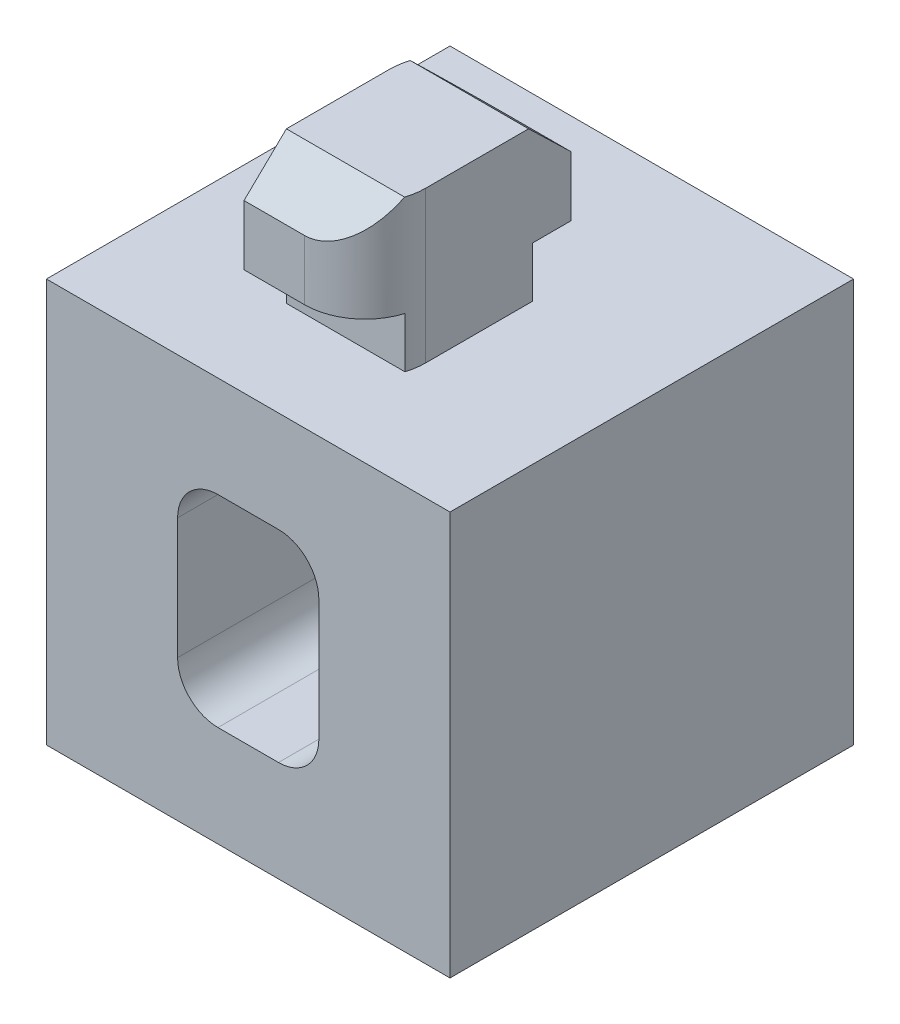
ISO-10303-21;
HEADER;
FILE_DESCRIPTION(('STEP AP214'),'2;1');
FILE_NAME('part.step','',(''),(''),'','','');
FILE_SCHEMA(('AUTOMOTIVE_DESIGN { 1 0 10303 214 1 1 1 1 }'));
ENDSEC;
DATA;
#1=APPLICATION_CONTEXT('core data for automotive mechanical design processes');
#2=APPLICATION_PROTOCOL_DEFINITION('international standard','automotive_design',2000,#1);
#3=PRODUCT_CONTEXT('',#1,'mechanical');
#4=PRODUCT('Part','Part','',(#3));
#5=PRODUCT_RELATED_PRODUCT_CATEGORY('part','',(#4));
#6=PRODUCT_DEFINITION_FORMATION('','',#4);
#7=PRODUCT_DEFINITION_CONTEXT('part definition',#1,'design');
#8=PRODUCT_DEFINITION('design','',#6,#7);
#9=PRODUCT_DEFINITION_SHAPE('','',#8);
#10=(LENGTH_UNIT() NAMED_UNIT(*) SI_UNIT(.MILLI.,.METRE.));
#11=(NAMED_UNIT(*) PLANE_ANGLE_UNIT() SI_UNIT($,.RADIAN.));
#12=(NAMED_UNIT(*) SI_UNIT($,.STERADIAN.) SOLID_ANGLE_UNIT());
#13=UNCERTAINTY_MEASURE_WITH_UNIT(LENGTH_MEASURE(1.E-05),#10,'distance_accuracy_value','');
#14=(GEOMETRIC_REPRESENTATION_CONTEXT(3) GLOBAL_UNCERTAINTY_ASSIGNED_CONTEXT((#13)) GLOBAL_UNIT_ASSIGNED_CONTEXT((#10,
#11,#12)) REPRESENTATION_CONTEXT('',''));
#15=CARTESIAN_POINT('',(0.,0.,0.));
#16=DIRECTION('',(0.,0.,1.));
#17=DIRECTION('',(1.,0.,0.));
#18=AXIS2_PLACEMENT_3D('',#15,#16,#17);
#19=CARTESIAN_POINT('',(-1.49999999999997,3.,10.));
#20=DIRECTION('',(0.,0.,-1.));
#21=DIRECTION('',(-1.,0.,0.));
#22=AXIS2_PLACEMENT_3D('',#19,#20,#21);
#23=CYLINDRICAL_SURFACE('',#22,2.00000000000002);
#24=DIRECTION('',(0.,0.,-1.));
#25=VECTOR('',#24,1.);
#26=CARTESIAN_POINT('',(-3.5,3.,10.));
#27=LINE('',#26,#25);
#28=CARTESIAN_POINT('',(-3.5,3.,10.));
#29=VERTEX_POINT('',#28);
#30=CARTESIAN_POINT('',(-3.5,3.,2.7));
#31=VERTEX_POINT('',#30);
#32=EDGE_CURVE('E488',#29,#31,#27,.T.);
#33=ORIENTED_EDGE('',*,*,#32,.T.);
#34=CARTESIAN_POINT('',(-1.49999999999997,3.,2.7));
#35=DIRECTION('',(0.,0.,-1.));
#36=DIRECTION('',(-1.,0.,0.));
#37=AXIS2_PLACEMENT_3D('',#34,#35,#36);
#38=CIRCLE('',#37,2.00000000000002);
#39=CARTESIAN_POINT('',(-1.49999999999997,5.,2.7));
#40=VERTEX_POINT('',#39);
#41=EDGE_CURVE('E345',#31,#40,#38,.T.);
#42=ORIENTED_EDGE('',*,*,#41,.T.);
#43=DIRECTION('',(0.,0.,-1.));
#44=VECTOR('',#43,1.);
#45=CARTESIAN_POINT('',(-1.49999999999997,5.,10.));
#46=LINE('',#45,#44);
#47=CARTESIAN_POINT('',(-1.49999999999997,5.,10.));
#48=VERTEX_POINT('',#47);
#49=EDGE_CURVE('E460',#48,#40,#46,.T.);
#50=ORIENTED_EDGE('',*,*,#49,.F.);
#51=CARTESIAN_POINT('',(-1.49999999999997,3.,10.));
#52=DIRECTION('',(0.,0.,1.));
#53=DIRECTION('',(1.,0.,0.));
#54=AXIS2_PLACEMENT_3D('',#51,#52,#53);
#55=CIRCLE('',#54,2.00000000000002);
#56=EDGE_CURVE('E419',#48,#29,#55,.T.);
#57=ORIENTED_EDGE('',*,*,#56,.T.);
#58=EDGE_LOOP('',(#33,#42,#50,#57));
#59=FACE_BOUND('',#58,.T.);
#60=ADVANCED_FACE('F35',(#59),#23,.F.);
#61=CARTESIAN_POINT('',(-3.5,-2.99999999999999,10.));
#62=DIRECTION('',(1.,0.,0.));
#63=DIRECTION('',(0.,0.,-1.));
#64=AXIS2_PLACEMENT_3D('',#61,#62,#63);
#65=PLANE('',#64);
#66=DIRECTION('',(0.,0.,-1.));
#67=VECTOR('',#66,1.);
#68=CARTESIAN_POINT('',(-3.49999999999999,-2.99999999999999,10.));
#69=LINE('',#68,#67);
#70=CARTESIAN_POINT('',(-3.49999999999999,-2.99999999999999,10.));
#71=VERTEX_POINT('',#70);
#72=CARTESIAN_POINT('',(-3.49999999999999,-2.99999999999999,2.7));
#73=VERTEX_POINT('',#72);
#74=EDGE_CURVE('E484',#71,#73,#69,.T.);
#75=ORIENTED_EDGE('',*,*,#74,.T.);
#76=DIRECTION('',(0.,1.,0.));
#77=VECTOR('',#76,1.);
#78=CARTESIAN_POINT('',(-3.5,-2.99999999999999,2.7));
#79=LINE('',#78,#77);
#80=EDGE_CURVE('E342',#73,#31,#79,.T.);
#81=ORIENTED_EDGE('',*,*,#80,.T.);
#82=ORIENTED_EDGE('',*,*,#32,.F.);
#83=DIRECTION('',(0.,-1.,0.));
#84=VECTOR('',#83,1.);
#85=CARTESIAN_POINT('',(-3.5,-2.99999999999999,10.));
#86=LINE('',#85,#84);
#87=EDGE_CURVE('E421',#29,#71,#86,.T.);
#88=ORIENTED_EDGE('',*,*,#87,.T.);
#89=EDGE_LOOP('',(#75,#81,#82,#88));
#90=FACE_BOUND('',#89,.T.);
#91=ADVANCED_FACE('F614',(#90),#65,.T.);
#92=CARTESIAN_POINT('',(-1.49999999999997,-2.99999999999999,10.));
#93=DIRECTION('',(0.,0.,-1.));
#94=DIRECTION('',(-1.,0.,0.));
#95=AXIS2_PLACEMENT_3D('',#92,#93,#94);
#96=CYLINDRICAL_SURFACE('',#95,2.00000000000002);
#97=DIRECTION('',(0.,0.,-1.));
#98=VECTOR('',#97,1.);
#99=CARTESIAN_POINT('',(-1.49999999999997,-4.99999999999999,10.));
#100=LINE('',#99,#98);
#101=CARTESIAN_POINT('',(-1.49999999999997,-4.99999999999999,10.));
#102=VERTEX_POINT('',#101);
#103=CARTESIAN_POINT('',(-1.49999999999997,-4.99999999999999,2.7));
#104=VERTEX_POINT('',#103);
#105=EDGE_CURVE('E480',#102,#104,#100,.T.);
#106=ORIENTED_EDGE('',*,*,#105,.T.);
#107=CARTESIAN_POINT('',(-1.49999999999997,-2.99999999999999,2.7));
#108=DIRECTION('',(0.,0.,-1.));
#109=DIRECTION('',(-1.,0.,0.));
#110=AXIS2_PLACEMENT_3D('',#107,#108,#109);
#111=CIRCLE('',#110,2.00000000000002);
#112=EDGE_CURVE('E339',#104,#73,#111,.T.);
#113=ORIENTED_EDGE('',*,*,#112,.T.);
#114=ORIENTED_EDGE('',*,*,#74,.F.);
#115=CARTESIAN_POINT('',(-1.49999999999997,-2.99999999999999,10.));
#116=DIRECTION('',(0.,0.,1.));
#117=DIRECTION('',(1.,0.,0.));
#118=AXIS2_PLACEMENT_3D('',#115,#116,#117);
#119=CIRCLE('',#118,2.00000000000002);
#120=EDGE_CURVE('E424',#71,#102,#119,.T.);
#121=ORIENTED_EDGE('',*,*,#120,.T.);
#122=EDGE_LOOP('',(#106,#113,#114,#121));
#123=FACE_BOUND('',#122,.T.);
#124=ADVANCED_FACE('F621',(#123),#96,.F.);
#125=CARTESIAN_POINT('',(-1.49999999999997,-4.99999999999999,10.));
#126=DIRECTION('',(0.,1.,0.));
#127=DIRECTION('',(0.,0.,1.));
#128=AXIS2_PLACEMENT_3D('',#125,#126,#127);
#129=PLANE('',#128);
#130=DIRECTION('',(0.,0.,-1.));
#131=VECTOR('',#130,1.);
#132=CARTESIAN_POINT('',(1.5,-4.99999999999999,10.));
#133=LINE('',#132,#131);
#134=CARTESIAN_POINT('',(1.5,-4.99999999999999,10.));
#135=VERTEX_POINT('',#134);
#136=CARTESIAN_POINT('',(1.5,-4.99999999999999,2.7));
#137=VERTEX_POINT('',#136);
#138=EDGE_CURVE('E476',#135,#137,#133,.T.);
#139=ORIENTED_EDGE('',*,*,#138,.T.);
#140=DIRECTION('',(-1.,0.,0.));
#141=VECTOR('',#140,1.);
#142=CARTESIAN_POINT('',(-1.49999999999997,-4.99999999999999,2.7));
#143=LINE('',#142,#141);
#144=EDGE_CURVE('E336',#137,#104,#143,.T.);
#145=ORIENTED_EDGE('',*,*,#144,.T.);
#146=ORIENTED_EDGE('',*,*,#105,.F.);
#147=DIRECTION('',(1.,0.,0.));
#148=VECTOR('',#147,1.);
#149=CARTESIAN_POINT('',(-1.49999999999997,-4.99999999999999,10.));
#150=LINE('',#149,#148);
#151=EDGE_CURVE('E426',#102,#135,#150,.T.);
#152=ORIENTED_EDGE('',*,*,#151,.T.);
#153=EDGE_LOOP('',(#139,#145,#146,#152));
#154=FACE_BOUND('',#153,.T.);
#155=ADVANCED_FACE('F680',(#154),#129,.T.);
#156=CARTESIAN_POINT('',(1.5,-2.99999999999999,10.));
#157=DIRECTION('',(0.,0.,-1.));
#158=DIRECTION('',(-1.,0.,0.));
#159=AXIS2_PLACEMENT_3D('',#156,#157,#158);
#160=CYLINDRICAL_SURFACE('',#159,2.);
#161=DIRECTION('',(0.,0.,-1.));
#162=VECTOR('',#161,1.);
#163=CARTESIAN_POINT('',(3.5,-2.99999999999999,10.));
#164=LINE('',#163,#162);
#165=CARTESIAN_POINT('',(3.5,-2.99999999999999,10.));
#166=VERTEX_POINT('',#165);
#167=CARTESIAN_POINT('',(3.5,-2.99999999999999,2.7));
#168=VERTEX_POINT('',#167);
#169=EDGE_CURVE('E472',#166,#168,#164,.T.);
#170=ORIENTED_EDGE('',*,*,#169,.T.);
#171=CARTESIAN_POINT('',(1.5,-2.99999999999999,2.7));
#172=DIRECTION('',(0.,0.,-1.));
#173=DIRECTION('',(-1.,0.,0.));
#174=AXIS2_PLACEMENT_3D('',#171,#172,#173);
#175=CIRCLE('',#174,2.);
#176=EDGE_CURVE('E333',#168,#137,#175,.T.);
#177=ORIENTED_EDGE('',*,*,#176,.T.);
#178=ORIENTED_EDGE('',*,*,#138,.F.);
#179=CARTESIAN_POINT('',(1.5,-2.99999999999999,10.));
#180=DIRECTION('',(0.,0.,1.));
#181=DIRECTION('',(1.,0.,0.));
#182=AXIS2_PLACEMENT_3D('',#179,#180,#181);
#183=CIRCLE('',#182,2.);
#184=EDGE_CURVE('E428',#135,#166,#183,.T.);
#185=ORIENTED_EDGE('',*,*,#184,.T.);
#186=EDGE_LOOP('',(#170,#177,#178,#185));
#187=FACE_BOUND('',#186,.T.);
#188=ADVANCED_FACE('F686',(#187),#160,.F.);
#189=CARTESIAN_POINT('',(3.5,-2.99999999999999,10.));
#190=DIRECTION('',(-1.,0.,0.));
#191=DIRECTION('',(0.,0.,1.));
#192=AXIS2_PLACEMENT_3D('',#189,#190,#191);
#193=PLANE('',#192);
#194=DIRECTION('',(0.,0.,-1.));
#195=VECTOR('',#194,1.);
#196=CARTESIAN_POINT('',(3.5,3.,10.));
#197=LINE('',#196,#195);
#198=CARTESIAN_POINT('',(3.5,3.,10.));
#199=VERTEX_POINT('',#198);
#200=CARTESIAN_POINT('',(3.5,3.,2.7));
#201=VERTEX_POINT('',#200);
#202=EDGE_CURVE('E468',#199,#201,#197,.T.);
#203=ORIENTED_EDGE('',*,*,#202,.T.);
#204=DIRECTION('',(0.,-1.,0.));
#205=VECTOR('',#204,1.);
#206=CARTESIAN_POINT('',(3.5,-2.99999999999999,2.7));
#207=LINE('',#206,#205);
#208=EDGE_CURVE('E329',#201,#168,#207,.T.);
#209=ORIENTED_EDGE('',*,*,#208,.T.);
#210=ORIENTED_EDGE('',*,*,#169,.F.);
#211=DIRECTION('',(0.,1.,0.));
#212=VECTOR('',#211,1.);
#213=CARTESIAN_POINT('',(3.5,-2.99999999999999,10.));
#214=LINE('',#213,#212);
#215=EDGE_CURVE('E430',#166,#199,#214,.T.);
#216=ORIENTED_EDGE('',*,*,#215,.T.);
#217=EDGE_LOOP('',(#203,#209,#210,#216));
#218=FACE_BOUND('',#217,.T.);
#219=ADVANCED_FACE('F702',(#218),#193,.T.);
#220=CARTESIAN_POINT('',(1.5,3.,10.));
#221=DIRECTION('',(0.,0.,-1.));
#222=DIRECTION('',(-1.,0.,0.));
#223=AXIS2_PLACEMENT_3D('',#220,#221,#222);
#224=CYLINDRICAL_SURFACE('',#223,2.);
#225=DIRECTION('',(0.,0.,-1.));
#226=VECTOR('',#225,1.);
#227=CARTESIAN_POINT('',(1.5,5.,10.));
#228=LINE('',#227,#226);
#229=CARTESIAN_POINT('',(1.5,5.,10.));
#230=VERTEX_POINT('',#229);
#231=CARTESIAN_POINT('',(1.5,5.,2.7));
#232=VERTEX_POINT('',#231);
#233=EDGE_CURVE('E464',#230,#232,#228,.T.);
#234=ORIENTED_EDGE('',*,*,#233,.T.);
#235=CARTESIAN_POINT('',(1.5,3.,2.7));
#236=DIRECTION('',(0.,0.,-1.));
#237=DIRECTION('',(-1.,0.,0.));
#238=AXIS2_PLACEMENT_3D('',#235,#236,#237);
#239=CIRCLE('',#238,2.);
#240=EDGE_CURVE('E326',#232,#201,#239,.T.);
#241=ORIENTED_EDGE('',*,*,#240,.T.);
#242=ORIENTED_EDGE('',*,*,#202,.F.);
#243=CARTESIAN_POINT('',(1.5,3.,10.));
#244=DIRECTION('',(0.,0.,1.));
#245=DIRECTION('',(1.,0.,0.));
#246=AXIS2_PLACEMENT_3D('',#243,#244,#245);
#247=CIRCLE('',#246,2.);
#248=EDGE_CURVE('E432',#199,#230,#247,.T.);
#249=ORIENTED_EDGE('',*,*,#248,.T.);
#250=EDGE_LOOP('',(#234,#241,#242,#249));
#251=FACE_BOUND('',#250,.T.);
#252=ADVANCED_FACE('F708',(#251),#224,.F.);
#253=CARTESIAN_POINT('',(-1.49999999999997,5.,10.));
#254=DIRECTION('',(0.,-1.,0.));
#255=DIRECTION('',(0.,0.,-1.));
#256=AXIS2_PLACEMENT_3D('',#253,#254,#255);
#257=PLANE('',#256);
#258=ORIENTED_EDGE('',*,*,#49,.T.);
#259=DIRECTION('',(1.,0.,0.));
#260=VECTOR('',#259,1.);
#261=CARTESIAN_POINT('',(-1.49999999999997,5.,2.7));
#262=LINE('',#261,#260);
#263=EDGE_CURVE('E521',#40,#232,#262,.T.);
#264=ORIENTED_EDGE('',*,*,#263,.T.);
#265=ORIENTED_EDGE('',*,*,#233,.F.);
#266=DIRECTION('',(-1.,0.,0.));
#267=VECTOR('',#266,1.);
#268=CARTESIAN_POINT('',(-1.49999999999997,5.,10.));
#269=LINE('',#268,#267);
#270=EDGE_CURVE('E435',#230,#48,#269,.T.);
#271=ORIENTED_EDGE('',*,*,#270,.T.);
#272=EDGE_LOOP('',(#258,#264,#265,#271));
#273=FACE_BOUND('',#272,.T.);
#274=ADVANCED_FACE('F711',(#273),#257,.T.);
#275=CARTESIAN_POINT('',(10.,9.99999999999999,10.));
#276=DIRECTION('',(0.,0.,1.));
#277=DIRECTION('',(1.,0.,0.));
#278=AXIS2_PLACEMENT_3D('',#275,#276,#277);
#279=PLANE('',#278);
#280=DIRECTION('',(0.,1.,0.));
#281=VECTOR('',#280,1.);
#282=CARTESIAN_POINT('',(10.,-10.,10.));
#283=LINE('',#282,#281);
#284=CARTESIAN_POINT('',(10.,-10.,10.));
#285=VERTEX_POINT('',#284);
#286=CARTESIAN_POINT('',(10.,9.99999999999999,10.));
#287=VERTEX_POINT('',#286);
#288=EDGE_CURVE('E492',#285,#287,#283,.T.);
#289=ORIENTED_EDGE('',*,*,#288,.T.);
#290=DIRECTION('',(-1.,0.,0.));
#291=VECTOR('',#290,1.);
#292=CARTESIAN_POINT('',(10.,9.99999999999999,10.));
#293=LINE('',#292,#291);
#294=CARTESIAN_POINT('',(-9.99999999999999,9.99999999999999,10.));
#295=VERTEX_POINT('',#294);
#296=EDGE_CURVE('E495',#287,#295,#293,.T.);
#297=ORIENTED_EDGE('',*,*,#296,.T.);
#298=DIRECTION('',(0.,-1.,0.));
#299=VECTOR('',#298,1.);
#300=CARTESIAN_POINT('',(-9.99999999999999,9.99999999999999,10.));
#301=LINE('',#300,#299);
#302=CARTESIAN_POINT('',(-9.99999999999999,-10.,10.));
#303=VERTEX_POINT('',#302);
#304=EDGE_CURVE('E498',#295,#303,#301,.T.);
#305=ORIENTED_EDGE('',*,*,#304,.T.);
#306=DIRECTION('',(1.,0.,0.));
#307=VECTOR('',#306,1.);
#308=CARTESIAN_POINT('',(-9.99999999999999,-10.,10.));
#309=LINE('',#308,#307);
#310=EDGE_CURVE('E500',#303,#285,#309,.T.);
#311=ORIENTED_EDGE('',*,*,#310,.T.);
#312=EDGE_LOOP('',(#289,#297,#305,#311));
#313=FACE_BOUND('',#312,.T.);
#314=ORIENTED_EDGE('',*,*,#87,.F.);
#315=ORIENTED_EDGE('',*,*,#56,.F.);
#316=ORIENTED_EDGE('',*,*,#270,.F.);
#317=ORIENTED_EDGE('',*,*,#248,.F.);
#318=ORIENTED_EDGE('',*,*,#215,.F.);
#319=ORIENTED_EDGE('',*,*,#184,.F.);
#320=ORIENTED_EDGE('',*,*,#151,.F.);
#321=ORIENTED_EDGE('',*,*,#120,.F.);
#322=EDGE_LOOP('',(#314,#315,#316,#317,#318,#319,#320,#321));
#323=FACE_BOUND('',#322,.T.);
#324=ADVANCED_FACE('F696',(#313,#323),#279,.T.);
#325=CARTESIAN_POINT('',(10.,9.99999999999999,-10.));
#326=DIRECTION('',(0.,0.,1.));
#327=DIRECTION('',(1.,0.,0.));
#328=AXIS2_PLACEMENT_3D('',#325,#326,#327);
#329=PLANE('',#328);
#330=DIRECTION('',(0.,1.,0.));
#331=VECTOR('',#330,1.);
#332=CARTESIAN_POINT('',(10.,-10.,-10.));
#333=LINE('',#332,#331);
#334=CARTESIAN_POINT('',(10.,-10.,-10.));
#335=VERTEX_POINT('',#334);
#336=CARTESIAN_POINT('',(10.,9.99999999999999,-10.));
#337=VERTEX_POINT('',#336);
#338=EDGE_CURVE('E491',#335,#337,#333,.T.);
#339=ORIENTED_EDGE('',*,*,#338,.F.);
#340=DIRECTION('',(1.,0.,0.));
#341=VECTOR('',#340,1.);
#342=CARTESIAN_POINT('',(-9.99999999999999,-10.,-10.));
#343=LINE('',#342,#341);
#344=CARTESIAN_POINT('',(-9.99999999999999,-10.,-10.));
#345=VERTEX_POINT('',#344);
#346=EDGE_CURVE('E496',#345,#335,#343,.T.);
#347=ORIENTED_EDGE('',*,*,#346,.F.);
#348=DIRECTION('',(0.,-1.,0.));
#349=VECTOR('',#348,1.);
#350=CARTESIAN_POINT('',(-9.99999999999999,9.99999999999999,-10.));
#351=LINE('',#350,#349);
#352=CARTESIAN_POINT('',(-9.99999999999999,9.99999999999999,-10.));
#353=VERTEX_POINT('',#352);
#354=EDGE_CURVE('E507',#353,#345,#351,.T.);
#355=ORIENTED_EDGE('',*,*,#354,.F.);
#356=DIRECTION('',(-1.,0.,0.));
#357=VECTOR('',#356,1.);
#358=CARTESIAN_POINT('',(10.,9.99999999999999,-10.));
#359=LINE('',#358,#357);
#360=EDGE_CURVE('E505',#337,#353,#359,.T.);
#361=ORIENTED_EDGE('',*,*,#360,.F.);
#362=EDGE_LOOP('',(#339,#347,#355,#361));
#363=FACE_BOUND('',#362,.T.);
#364=CARTESIAN_POINT('',(-1.49999999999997,3.,-10.));
#365=DIRECTION('',(0.,0.,1.));
#366=DIRECTION('',(1.,0.,0.));
#367=AXIS2_PLACEMENT_3D('',#364,#365,#366);
#368=CIRCLE('',#367,2.00000000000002);
#369=CARTESIAN_POINT('',(-1.49999999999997,5.,-10.));
#370=VERTEX_POINT('',#369);
#371=CARTESIAN_POINT('',(-3.5,3.,-10.));
#372=VERTEX_POINT('',#371);
#373=EDGE_CURVE('E418',#370,#372,#368,.T.);
#374=ORIENTED_EDGE('',*,*,#373,.T.);
#375=DIRECTION('',(0.,-1.,0.));
#376=VECTOR('',#375,1.);
#377=CARTESIAN_POINT('',(-3.5,-2.99999999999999,-10.));
#378=LINE('',#377,#376);
#379=CARTESIAN_POINT('',(-3.49999999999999,-2.99999999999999,-10.));
#380=VERTEX_POINT('',#379);
#381=EDGE_CURVE('E440',#372,#380,#378,.T.);
#382=ORIENTED_EDGE('',*,*,#381,.T.);
#383=CARTESIAN_POINT('',(-1.49999999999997,-2.99999999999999,-10.));
#384=DIRECTION('',(0.,0.,1.));
#385=DIRECTION('',(1.,0.,0.));
#386=AXIS2_PLACEMENT_3D('',#383,#384,#385);
#387=CIRCLE('',#386,2.00000000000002);
#388=CARTESIAN_POINT('',(-1.49999999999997,-4.99999999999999,-10.));
#389=VERTEX_POINT('',#388);
#390=EDGE_CURVE('E443',#380,#389,#387,.T.);
#391=ORIENTED_EDGE('',*,*,#390,.T.);
#392=DIRECTION('',(1.,0.,0.));
#393=VECTOR('',#392,1.);
#394=CARTESIAN_POINT('',(-1.49999999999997,-4.99999999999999,-10.));
#395=LINE('',#394,#393);
#396=CARTESIAN_POINT('',(1.5,-4.99999999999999,-10.));
#397=VERTEX_POINT('',#396);
#398=EDGE_CURVE('E446',#389,#397,#395,.T.);
#399=ORIENTED_EDGE('',*,*,#398,.T.);
#400=CARTESIAN_POINT('',(1.5,-2.99999999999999,-10.));
#401=DIRECTION('',(0.,0.,1.));
#402=DIRECTION('',(1.,0.,0.));
#403=AXIS2_PLACEMENT_3D('',#400,#401,#402);
#404=CIRCLE('',#403,2.);
#405=CARTESIAN_POINT('',(3.5,-2.99999999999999,-10.));
#406=VERTEX_POINT('',#405);
#407=EDGE_CURVE('E449',#397,#406,#404,.T.);
#408=ORIENTED_EDGE('',*,*,#407,.T.);
#409=DIRECTION('',(0.,1.,0.));
#410=VECTOR('',#409,1.);
#411=CARTESIAN_POINT('',(3.5,-2.99999999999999,-10.));
#412=LINE('',#411,#410);
#413=CARTESIAN_POINT('',(3.5,3.,-10.));
#414=VERTEX_POINT('',#413);
#415=EDGE_CURVE('E452',#406,#414,#412,.T.);
#416=ORIENTED_EDGE('',*,*,#415,.T.);
#417=CARTESIAN_POINT('',(1.5,3.,-10.));
#418=DIRECTION('',(0.,0.,1.));
#419=DIRECTION('',(1.,0.,0.));
#420=AXIS2_PLACEMENT_3D('',#417,#418,#419);
#421=CIRCLE('',#420,2.);
#422=CARTESIAN_POINT('',(1.5,5.,-10.));
#423=VERTEX_POINT('',#422);
#424=EDGE_CURVE('E455',#414,#423,#421,.T.);
#425=ORIENTED_EDGE('',*,*,#424,.T.);
#426=DIRECTION('',(-1.,0.,0.));
#427=VECTOR('',#426,1.);
#428=CARTESIAN_POINT('',(-1.49999999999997,5.,-10.));
#429=LINE('',#428,#427);
#430=EDGE_CURVE('E422',#423,#370,#429,.T.);
#431=ORIENTED_EDGE('',*,*,#430,.T.);
#432=EDGE_LOOP('',(#374,#382,#391,#399,#408,#416,#425,#431));
#433=FACE_BOUND('',#432,.T.);
#434=ADVANCED_FACE('F647',(#363,#433),#329,.F.);
#435=CARTESIAN_POINT('',(10.,-10.,10.));
#436=DIRECTION('',(-1.,0.,0.));
#437=DIRECTION('',(0.,0.,1.));
#438=AXIS2_PLACEMENT_3D('',#435,#436,#437);
#439=PLANE('',#438);
#440=ORIENTED_EDGE('',*,*,#338,.T.);
#441=DIRECTION('',(0.,0.,-1.));
#442=VECTOR('',#441,1.);
#443=CARTESIAN_POINT('',(10.,9.99999999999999,10.));
#444=LINE('',#443,#442);
#445=EDGE_CURVE('E518',#287,#337,#444,.T.);
#446=ORIENTED_EDGE('',*,*,#445,.F.);
#447=ORIENTED_EDGE('',*,*,#288,.F.);
#448=DIRECTION('',(0.,0.,-1.));
#449=VECTOR('',#448,1.);
#450=CARTESIAN_POINT('',(10.,-10.,10.));
#451=LINE('',#450,#449);
#452=EDGE_CURVE('E502',#285,#335,#451,.T.);
#453=ORIENTED_EDGE('',*,*,#452,.T.);
#454=EDGE_LOOP('',(#440,#446,#447,#453));
#455=FACE_BOUND('',#454,.T.);
#456=ADVANCED_FACE('F896',(#455),#439,.F.);
#457=CARTESIAN_POINT('',(10.,9.99999999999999,10.));
#458=DIRECTION('',(0.,-1.,0.));
#459=DIRECTION('',(0.,0.,-1.));
#460=AXIS2_PLACEMENT_3D('',#457,#458,#459);
#461=PLANE('',#460);
#462=DIRECTION('',(-1.,0.,0.));
#463=VECTOR('',#462,1.);
#464=CARTESIAN_POINT('',(3.,9.99999999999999,-1.09999999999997));
#465=LINE('',#464,#463);
#466=CARTESIAN_POINT('',(3.,9.99999999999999,-1.09999999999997));
#467=VERTEX_POINT('',#466);
#468=CARTESIAN_POINT('',(-2.78786220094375,9.99999999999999,-1.09999999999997));
#469=VERTEX_POINT('',#468);
#470=EDGE_CURVE('E405',#467,#469,#465,.T.);
#471=ORIENTED_EDGE('',*,*,#470,.F.);
#472=DIRECTION('',(0.,0.,-1.));
#473=VECTOR('',#472,1.);
#474=CARTESIAN_POINT('',(3.,9.99999999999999,5.10000000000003));
#475=LINE('',#474,#473);
#476=CARTESIAN_POINT('',(3.,9.99999999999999,4.20807235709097));
#477=VERTEX_POINT('',#476);
#478=EDGE_CURVE('E366',#477,#467,#475,.T.);
#479=ORIENTED_EDGE('',*,*,#478,.F.);
#480=CARTESIAN_POINT('',(0.,9.99999999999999,4.20807235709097));
#481=DIRECTION('',(0.,-1.,0.));
#482=DIRECTION('',(0.,0.,-1.));
#483=AXIS2_PLACEMENT_3D('',#480,#481,#482);
#484=CIRCLE('',#483,3.);
#485=CARTESIAN_POINT('',(2.86434374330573,9.99999999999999,5.10000000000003));
#486=VERTEX_POINT('',#485);
#487=EDGE_CURVE('E11',#477,#486,#484,.T.);
#488=ORIENTED_EDGE('',*,*,#487,.T.);
#489=DIRECTION('',(-1.,0.,0.));
#490=VECTOR('',#489,1.);
#491=CARTESIAN_POINT('',(3.,9.99999999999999,5.10000000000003));
#492=LINE('',#491,#490);
#493=CARTESIAN_POINT('',(-3.,9.99999999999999,5.10000000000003));
#494=VERTEX_POINT('',#493);
#495=EDGE_CURVE('E408',#486,#494,#492,.T.);
#496=ORIENTED_EDGE('',*,*,#495,.T.);
#497=DIRECTION('',(0.,0.,-1.));
#498=VECTOR('',#497,1.);
#499=CARTESIAN_POINT('',(-3.,9.99999999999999,5.10000000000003));
#500=LINE('',#499,#498);
#501=CARTESIAN_POINT('',(-3.,9.99999999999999,0.0080723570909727));
#502=VERTEX_POINT('',#501);
#503=EDGE_CURVE('E367',#494,#502,#500,.T.);
#504=ORIENTED_EDGE('',*,*,#503,.T.);
#505=CARTESIAN_POINT('',(0.,9.99999999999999,0.00807235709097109));
#506=DIRECTION('',(0.,-1.,0.));
#507=DIRECTION('',(0.,0.,-1.));
#508=AXIS2_PLACEMENT_3D('',#505,#506,#507);
#509=CIRCLE('',#508,3.);
#510=EDGE_CURVE('E43',#502,#469,#509,.T.);
#511=ORIENTED_EDGE('',*,*,#510,.T.);
#512=EDGE_LOOP('',(#471,#479,#488,#496,#504,#511));
#513=FACE_BOUND('',#512,.T.);
#514=ORIENTED_EDGE('',*,*,#360,.T.);
#515=DIRECTION('',(0.,0.,-1.));
#516=VECTOR('',#515,1.);
#517=CARTESIAN_POINT('',(-9.99999999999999,9.99999999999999,10.));
#518=LINE('',#517,#516);
#519=EDGE_CURVE('E515',#295,#353,#518,.T.);
#520=ORIENTED_EDGE('',*,*,#519,.F.);
#521=ORIENTED_EDGE('',*,*,#296,.F.);
#522=ORIENTED_EDGE('',*,*,#445,.T.);
#523=EDGE_LOOP('',(#514,#520,#521,#522));
#524=FACE_BOUND('',#523,.T.);
#525=ADVANCED_FACE('F552',(#513,#524),#461,.F.);
#526=CARTESIAN_POINT('',(-9.99999999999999,9.99999999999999,10.));
#527=DIRECTION('',(1.,0.,0.));
#528=DIRECTION('',(0.,0.,-1.));
#529=AXIS2_PLACEMENT_3D('',#526,#527,#528);
#530=PLANE('',#529);
#531=ORIENTED_EDGE('',*,*,#354,.T.);
#532=DIRECTION('',(0.,0.,-1.));
#533=VECTOR('',#532,1.);
#534=CARTESIAN_POINT('',(-9.99999999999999,-10.,10.));
#535=LINE('',#534,#533);
#536=EDGE_CURVE('E512',#303,#345,#535,.T.);
#537=ORIENTED_EDGE('',*,*,#536,.F.);
#538=ORIENTED_EDGE('',*,*,#304,.F.);
#539=ORIENTED_EDGE('',*,*,#519,.T.);
#540=EDGE_LOOP('',(#531,#537,#538,#539));
#541=FACE_BOUND('',#540,.T.);
#542=ADVANCED_FACE('F634',(#541),#530,.F.);
#543=CARTESIAN_POINT('',(-9.99999999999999,-10.,10.));
#544=DIRECTION('',(0.,1.,0.));
#545=DIRECTION('',(0.,0.,1.));
#546=AXIS2_PLACEMENT_3D('',#543,#544,#545);
#547=PLANE('',#546);
#548=DIRECTION('',(0.,0.,1.));
#549=VECTOR('',#548,1.);
#550=CARTESIAN_POINT('',(5.15,-10.,-2.7));
#551=LINE('',#550,#549);
#552=CARTESIAN_POINT('',(5.15,-10.,-2.7));
#553=VERTEX_POINT('',#552);
#554=CARTESIAN_POINT('',(5.15,-10.,2.7));
#555=VERTEX_POINT('',#554);
#556=EDGE_CURVE('E297',#553,#555,#551,.T.);
#557=ORIENTED_EDGE('',*,*,#556,.F.);
#558=DIRECTION('',(1.,0.,0.));
#559=VECTOR('',#558,1.);
#560=CARTESIAN_POINT('',(5.15,-10.,-2.7));
#561=LINE('',#560,#559);
#562=CARTESIAN_POINT('',(-5.15,-10.,-2.7));
#563=VERTEX_POINT('',#562);
#564=EDGE_CURVE('E304',#563,#553,#561,.T.);
#565=ORIENTED_EDGE('',*,*,#564,.F.);
#566=DIRECTION('',(0.,0.,1.));
#567=VECTOR('',#566,1.);
#568=CARTESIAN_POINT('',(-5.15,-10.,-2.7));
#569=LINE('',#568,#567);
#570=CARTESIAN_POINT('',(-5.15,-10.,2.7));
#571=VERTEX_POINT('',#570);
#572=EDGE_CURVE('E330',#563,#571,#569,.T.);
#573=ORIENTED_EDGE('',*,*,#572,.T.);
#574=DIRECTION('',(1.,0.,0.));
#575=VECTOR('',#574,1.);
#576=CARTESIAN_POINT('',(5.15,-10.,2.7));
#577=LINE('',#576,#575);
#578=EDGE_CURVE('E318',#571,#555,#577,.T.);
#579=ORIENTED_EDGE('',*,*,#578,.T.);
#580=EDGE_LOOP('',(#557,#565,#573,#579));
#581=FACE_BOUND('',#580,.T.);
#582=ORIENTED_EDGE('',*,*,#346,.T.);
#583=ORIENTED_EDGE('',*,*,#452,.F.);
#584=ORIENTED_EDGE('',*,*,#310,.F.);
#585=ORIENTED_EDGE('',*,*,#536,.T.);
#586=EDGE_LOOP('',(#582,#583,#584,#585));
#587=FACE_BOUND('',#586,.T.);
#588=ADVANCED_FACE('F316',(#581,#587),#547,.F.);
#589=CARTESIAN_POINT('',(-1.49999999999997,3.,-2.7));
#590=DIRECTION('',(0.,0.,-1.));
#591=DIRECTION('',(-1.,0.,0.));
#592=AXIS2_PLACEMENT_3D('',#589,#590,#591);
#593=CIRCLE('',#592,2.00000000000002);
#594=CARTESIAN_POINT('',(-3.5,3.,-2.7));
#595=VERTEX_POINT('',#594);
#596=CARTESIAN_POINT('',(-1.49999999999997,5.,-2.7));
#597=VERTEX_POINT('',#596);
#598=EDGE_CURVE('E360',#595,#597,#593,.T.);
#599=ORIENTED_EDGE('',*,*,#598,.F.);
#600=EDGE_CURVE('E487',#595,#372,#27,.T.);
#601=ORIENTED_EDGE('',*,*,#600,.T.);
#602=ORIENTED_EDGE('',*,*,#373,.F.);
#603=EDGE_CURVE('E437',#597,#370,#46,.T.);
#604=ORIENTED_EDGE('',*,*,#603,.F.);
#605=EDGE_LOOP('',(#599,#601,#602,#604));
#606=FACE_BOUND('',#605,.T.);
#607=ADVANCED_FACE('F617',(#606),#23,.F.);
#608=DIRECTION('',(0.,1.,0.));
#609=VECTOR('',#608,1.);
#610=CARTESIAN_POINT('',(-3.5,-2.99999999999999,-2.7));
#611=LINE('',#610,#609);
#612=CARTESIAN_POINT('',(-3.49999999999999,-2.99999999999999,-2.7));
#613=VERTEX_POINT('',#612);
#614=EDGE_CURVE('E358',#613,#595,#611,.T.);
#615=ORIENTED_EDGE('',*,*,#614,.F.);
#616=EDGE_CURVE('E483',#613,#380,#69,.T.);
#617=ORIENTED_EDGE('',*,*,#616,.T.);
#618=ORIENTED_EDGE('',*,*,#381,.F.);
#619=ORIENTED_EDGE('',*,*,#600,.F.);
#620=EDGE_LOOP('',(#615,#617,#618,#619));
#621=FACE_BOUND('',#620,.T.);
#622=ADVANCED_FACE('F624',(#621),#65,.T.);
#623=CARTESIAN_POINT('',(-1.49999999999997,-2.99999999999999,-2.7));
#624=DIRECTION('',(0.,0.,-1.));
#625=DIRECTION('',(-1.,0.,0.));
#626=AXIS2_PLACEMENT_3D('',#623,#624,#625);
#627=CIRCLE('',#626,2.00000000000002);
#628=CARTESIAN_POINT('',(-1.49999999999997,-4.99999999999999,-2.7));
#629=VERTEX_POINT('',#628);
#630=EDGE_CURVE('E356',#629,#613,#627,.T.);
#631=ORIENTED_EDGE('',*,*,#630,.F.);
#632=EDGE_CURVE('E479',#629,#389,#100,.T.);
#633=ORIENTED_EDGE('',*,*,#632,.T.);
#634=ORIENTED_EDGE('',*,*,#390,.F.);
#635=ORIENTED_EDGE('',*,*,#616,.F.);
#636=EDGE_LOOP('',(#631,#633,#634,#635));
#637=FACE_BOUND('',#636,.T.);
#638=ADVANCED_FACE('F632',(#637),#96,.F.);
#639=DIRECTION('',(-1.,0.,0.));
#640=VECTOR('',#639,1.);
#641=CARTESIAN_POINT('',(-1.49999999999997,-4.99999999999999,-2.7));
#642=LINE('',#641,#640);
#643=CARTESIAN_POINT('',(1.5,-4.99999999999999,-2.7));
#644=VERTEX_POINT('',#643);
#645=EDGE_CURVE('E354',#644,#629,#642,.T.);
#646=ORIENTED_EDGE('',*,*,#645,.F.);
#647=EDGE_CURVE('E475',#644,#397,#133,.T.);
#648=ORIENTED_EDGE('',*,*,#647,.T.);
#649=ORIENTED_EDGE('',*,*,#398,.F.);
#650=ORIENTED_EDGE('',*,*,#632,.F.);
#651=EDGE_LOOP('',(#646,#648,#649,#650));
#652=FACE_BOUND('',#651,.T.);
#653=ADVANCED_FACE('F670',(#652),#129,.T.);
#654=CARTESIAN_POINT('',(1.5,-2.99999999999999,-2.7));
#655=DIRECTION('',(0.,0.,-1.));
#656=DIRECTION('',(-1.,0.,0.));
#657=AXIS2_PLACEMENT_3D('',#654,#655,#656);
#658=CIRCLE('',#657,2.);
#659=CARTESIAN_POINT('',(3.5,-2.99999999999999,-2.7));
#660=VERTEX_POINT('',#659);
#661=EDGE_CURVE('E352',#660,#644,#658,.T.);
#662=ORIENTED_EDGE('',*,*,#661,.F.);
#663=EDGE_CURVE('E471',#660,#406,#164,.T.);
#664=ORIENTED_EDGE('',*,*,#663,.T.);
#665=ORIENTED_EDGE('',*,*,#407,.F.);
#666=ORIENTED_EDGE('',*,*,#647,.F.);
#667=EDGE_LOOP('',(#662,#664,#665,#666));
#668=FACE_BOUND('',#667,.T.);
#669=ADVANCED_FACE('F666',(#668),#160,.F.);
#670=DIRECTION('',(0.,-1.,0.));
#671=VECTOR('',#670,1.);
#672=CARTESIAN_POINT('',(3.5,-2.99999999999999,-2.7));
#673=LINE('',#672,#671);
#674=CARTESIAN_POINT('',(3.5,3.,-2.7));
#675=VERTEX_POINT('',#674);
#676=EDGE_CURVE('E350',#675,#660,#673,.T.);
#677=ORIENTED_EDGE('',*,*,#676,.F.);
#678=EDGE_CURVE('E467',#675,#414,#197,.T.);
#679=ORIENTED_EDGE('',*,*,#678,.T.);
#680=ORIENTED_EDGE('',*,*,#415,.F.);
#681=ORIENTED_EDGE('',*,*,#663,.F.);
#682=EDGE_LOOP('',(#677,#679,#680,#681));
#683=FACE_BOUND('',#682,.T.);
#684=ADVANCED_FACE('F660',(#683),#193,.T.);
#685=CARTESIAN_POINT('',(1.5,3.,-2.7));
#686=DIRECTION('',(0.,0.,-1.));
#687=DIRECTION('',(-1.,0.,0.));
#688=AXIS2_PLACEMENT_3D('',#685,#686,#687);
#689=CIRCLE('',#688,2.);
#690=CARTESIAN_POINT('',(1.5,5.,-2.7));
#691=VERTEX_POINT('',#690);
#692=EDGE_CURVE('E348',#691,#675,#689,.T.);
#693=ORIENTED_EDGE('',*,*,#692,.F.);
#694=EDGE_CURVE('E463',#691,#423,#228,.T.);
#695=ORIENTED_EDGE('',*,*,#694,.T.);
#696=ORIENTED_EDGE('',*,*,#424,.F.);
#697=ORIENTED_EDGE('',*,*,#678,.F.);
#698=EDGE_LOOP('',(#693,#695,#696,#697));
#699=FACE_BOUND('',#698,.T.);
#700=ADVANCED_FACE('F657',(#699),#224,.F.);
#701=DIRECTION('',(1.,0.,0.));
#702=VECTOR('',#701,1.);
#703=CARTESIAN_POINT('',(-1.49999999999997,5.,-2.7));
#704=LINE('',#703,#702);
#705=EDGE_CURVE('E524',#597,#691,#704,.T.);
#706=ORIENTED_EDGE('',*,*,#705,.F.);
#707=ORIENTED_EDGE('',*,*,#603,.T.);
#708=ORIENTED_EDGE('',*,*,#430,.F.);
#709=ORIENTED_EDGE('',*,*,#694,.F.);
#710=EDGE_LOOP('',(#706,#707,#708,#709));
#711=FACE_BOUND('',#710,.T.);
#712=ADVANCED_FACE('F652',(#711),#257,.T.);
#713=CARTESIAN_POINT('',(3.,17.5,5.10807235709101));
#714=DIRECTION('',(0.,-1.,0.));
#715=DIRECTION('',(0.,0.,-1.));
#716=AXIS2_PLACEMENT_3D('',#713,#714,#715);
#717=PLANE('',#716);
#718=DIRECTION('',(-1.,0.,0.));
#719=VECTOR('',#718,1.);
#720=CARTESIAN_POINT('',(3.,17.5,-0.891927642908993));
#721=LINE('',#720,#719);
#722=CARTESIAN_POINT('',(3.,17.5,-0.891927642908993));
#723=VERTEX_POINT('',#722);
#724=CARTESIAN_POINT('',(-2.86181760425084,17.5,-0.891927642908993));
#725=VERTEX_POINT('',#724);
#726=EDGE_CURVE('E377',#723,#725,#721,.T.);
#727=ORIENTED_EDGE('',*,*,#726,.T.);
#728=CARTESIAN_POINT('',(0.,17.5,0.00807235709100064));
#729=DIRECTION('',(0.,-1.,0.));
#730=DIRECTION('',(0.,0.,-1.));
#731=AXIS2_PLACEMENT_3D('',#728,#729,#730);
#732=CIRCLE('',#731,3.);
#733=CARTESIAN_POINT('',(-3.,17.5,0.00807235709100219));
#734=VERTEX_POINT('',#733);
#735=EDGE_CURVE('E533',#725,#734,#732,.F.);
#736=ORIENTED_EDGE('',*,*,#735,.T.);
#737=DIRECTION('',(0.,0.,1.));
#738=VECTOR('',#737,1.);
#739=CARTESIAN_POINT('',(-3.,17.5,5.10807235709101));
#740=LINE('',#739,#738);
#741=CARTESIAN_POINT('',(-3.,17.5,5.10807235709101));
#742=VERTEX_POINT('',#741);
#743=EDGE_CURVE('E362',#734,#742,#740,.T.);
#744=ORIENTED_EDGE('',*,*,#743,.T.);
#745=DIRECTION('',(-1.,0.,0.));
#746=VECTOR('',#745,1.);
#747=CARTESIAN_POINT('',(3.,17.5,5.10807235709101));
#748=LINE('',#747,#746);
#749=CARTESIAN_POINT('',(2.86181760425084,17.5,5.10807235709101));
#750=VERTEX_POINT('',#749);
#751=EDGE_CURVE('E416',#750,#742,#748,.T.);
#752=ORIENTED_EDGE('',*,*,#751,.F.);
#753=CARTESIAN_POINT('',(0.,17.5,4.208072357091));
#754=DIRECTION('',(0.,-1.,0.));
#755=DIRECTION('',(0.,0.,-1.));
#756=AXIS2_PLACEMENT_3D('',#753,#754,#755);
#757=CIRCLE('',#756,3.);
#758=CARTESIAN_POINT('',(3.,17.5,4.208072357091));
#759=VERTEX_POINT('',#758);
#760=EDGE_CURVE('E531',#750,#759,#757,.F.);
#761=ORIENTED_EDGE('',*,*,#760,.T.);
#762=DIRECTION('',(0.,0.,1.));
#763=VECTOR('',#762,1.);
#764=CARTESIAN_POINT('',(3.,17.5,5.10807235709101));
#765=LINE('',#764,#763);
#766=EDGE_CURVE('E363',#723,#759,#765,.T.);
#767=ORIENTED_EDGE('',*,*,#766,.F.);
#768=EDGE_LOOP('',(#727,#736,#744,#752,#761,#767));
#769=FACE_BOUND('',#768,.T.);
#770=ADVANCED_FACE('F591',(#769),#717,.F.);
#771=CARTESIAN_POINT('',(3.,17.5,5.10807235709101));
#772=DIRECTION('',(0.,-0.719339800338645,-0.694658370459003));
#773=DIRECTION('',(0.,0.694658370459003,-0.719339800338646));
#774=AXIS2_PLACEMENT_3D('',#771,#772,#773);
#775=PLANE('',#774);
#776=DIRECTION('',(-1.,0.,0.));
#777=VECTOR('',#776,1.);
#778=CARTESIAN_POINT('',(3.,15.4720535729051,7.20807235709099));
#779=LINE('',#778,#777);
#780=CARTESIAN_POINT('',(0.,15.4720535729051,7.20807235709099));
#781=VERTEX_POINT('',#780);
#782=CARTESIAN_POINT('',(-3.,15.4720535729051,7.20807235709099));
#783=VERTEX_POINT('',#782);
#784=EDGE_CURVE('E414',#781,#783,#779,.T.);
#785=ORIENTED_EDGE('',*,*,#784,.F.);
#786=CARTESIAN_POINT('',(0.,18.3691198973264,4.20807235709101));
#787=DIRECTION('',(0.,-0.719339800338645,-0.694658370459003));
#788=DIRECTION('',(0.,0.694658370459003,-0.719339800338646));
#789=AXIS2_PLACEMENT_3D('',#786,#787,#788);
#790=ELLIPSE('',#789,4.17049077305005,3.);
#791=EDGE_CURVE('E548',#781,#750,#790,.F.);
#792=ORIENTED_EDGE('',*,*,#791,.T.);
#793=ORIENTED_EDGE('',*,*,#751,.T.);
#794=DIRECTION('',(0.,-0.694658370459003,0.719339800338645));
#795=VECTOR('',#794,1.);
#796=CARTESIAN_POINT('',(-3.,17.5,5.10807235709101));
#797=LINE('',#796,#795);
#798=EDGE_CURVE('E380',#742,#783,#797,.T.);
#799=ORIENTED_EDGE('',*,*,#798,.T.);
#800=EDGE_LOOP('',(#785,#792,#793,#799));
#801=FACE_BOUND('',#800,.T.);
#802=ADVANCED_FACE('F589',(#801),#775,.F.);
#803=CARTESIAN_POINT('',(3.,12.5,7.20807235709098));
#804=DIRECTION('',(0.,0.,-1.));
#805=DIRECTION('',(0.,1.,0.));
#806=AXIS2_PLACEMENT_3D('',#803,#804,#805);
#807=PLANE('',#806);
#808=DIRECTION('',(-1.,0.,0.));
#809=VECTOR('',#808,1.);
#810=CARTESIAN_POINT('',(3.,12.5,7.20807235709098));
#811=LINE('',#810,#809);
#812=CARTESIAN_POINT('',(0.,12.5,7.20807235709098));
#813=VERTEX_POINT('',#812);
#814=CARTESIAN_POINT('',(-3.,12.5,7.20807235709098));
#815=VERTEX_POINT('',#814);
#816=EDGE_CURVE('E412',#813,#815,#811,.T.);
#817=ORIENTED_EDGE('',*,*,#816,.F.);
#818=DIRECTION('',(0.,-1.,0.));
#819=VECTOR('',#818,1.);
#820=CARTESIAN_POINT('',(0.,15.4720535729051,7.20807235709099));
#821=LINE('',#820,#819);
#822=EDGE_CURVE('E50',#813,#781,#821,.F.);
#823=ORIENTED_EDGE('',*,*,#822,.T.);
#824=ORIENTED_EDGE('',*,*,#784,.T.);
#825=DIRECTION('',(0.,-1.,0.));
#826=VECTOR('',#825,1.);
#827=CARTESIAN_POINT('',(-3.,12.5,7.20807235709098));
#828=LINE('',#827,#826);
#829=EDGE_CURVE('E383',#783,#815,#828,.T.);
#830=ORIENTED_EDGE('',*,*,#829,.T.);
#831=EDGE_LOOP('',(#817,#823,#824,#830));
#832=FACE_BOUND('',#831,.T.);
#833=ADVANCED_FACE('F600',(#832),#807,.F.);
#834=CARTESIAN_POINT('',(3.,12.5,7.20807235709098));
#835=DIRECTION('',(0.,1.,0.));
#836=DIRECTION('',(0.,0.,1.));
#837=AXIS2_PLACEMENT_3D('',#834,#835,#836);
#838=PLANE('',#837);
#839=DIRECTION('',(-1.,0.,0.));
#840=VECTOR('',#839,1.);
#841=CARTESIAN_POINT('',(3.,12.5,5.10000000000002));
#842=LINE('',#841,#840);
#843=CARTESIAN_POINT('',(2.86434374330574,12.5,5.10000000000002));
#844=VERTEX_POINT('',#843);
#845=CARTESIAN_POINT('',(-3.,12.5,5.10000000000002));
#846=VERTEX_POINT('',#845);
#847=EDGE_CURVE('E410',#844,#846,#842,.T.);
#848=ORIENTED_EDGE('',*,*,#847,.F.);
#849=CARTESIAN_POINT('',(0.,12.5,4.20807235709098));
#850=DIRECTION('',(0.,1.,0.));
#851=DIRECTION('',(0.,0.,1.));
#852=AXIS2_PLACEMENT_3D('',#849,#850,#851);
#853=CIRCLE('',#852,3.);
#854=EDGE_CURVE('E58',#844,#813,#853,.F.);
#855=ORIENTED_EDGE('',*,*,#854,.T.);
#856=ORIENTED_EDGE('',*,*,#816,.T.);
#857=DIRECTION('',(0.,0.,-1.));
#858=VECTOR('',#857,1.);
#859=CARTESIAN_POINT('',(-3.,12.5,7.20807235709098));
#860=LINE('',#859,#858);
#861=EDGE_CURVE('E386',#815,#846,#860,.T.);
#862=ORIENTED_EDGE('',*,*,#861,.T.);
#863=EDGE_LOOP('',(#848,#855,#856,#862));
#864=FACE_BOUND('',#863,.T.);
#865=ADVANCED_FACE('F601',(#864),#838,.F.);
#866=CARTESIAN_POINT('',(3.,12.5,5.10000000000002));
#867=DIRECTION('',(0.,0.,-1.));
#868=DIRECTION('',(0.,1.,0.));
#869=AXIS2_PLACEMENT_3D('',#866,#867,#868);
#870=PLANE('',#869);
#871=ORIENTED_EDGE('',*,*,#495,.F.);
#872=DIRECTION('',(0.,1.,0.));
#873=VECTOR('',#872,1.);
#874=CARTESIAN_POINT('',(2.86434374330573,9.99999999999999,5.10000000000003));
#875=LINE('',#874,#873);
#876=EDGE_CURVE('E544',#486,#844,#875,.T.);
#877=ORIENTED_EDGE('',*,*,#876,.T.);
#878=ORIENTED_EDGE('',*,*,#847,.T.);
#879=DIRECTION('',(0.,-1.,0.));
#880=VECTOR('',#879,1.);
#881=CARTESIAN_POINT('',(-3.,12.5,5.10000000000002));
#882=LINE('',#881,#880);
#883=EDGE_CURVE('E389',#846,#494,#882,.T.);
#884=ORIENTED_EDGE('',*,*,#883,.T.);
#885=EDGE_LOOP('',(#871,#877,#878,#884));
#886=FACE_BOUND('',#885,.T.);
#887=ADVANCED_FACE('F583',(#886),#870,.F.);
#888=CARTESIAN_POINT('',(3.,12.5,-1.09999999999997));
#889=DIRECTION('',(0.,0.,1.));
#890=DIRECTION('',(0.,-1.,0.));
#891=AXIS2_PLACEMENT_3D('',#888,#889,#890);
#892=PLANE('',#891);
#893=ORIENTED_EDGE('',*,*,#470,.T.);
#894=DIRECTION('',(0.,1.,0.));
#895=VECTOR('',#894,1.);
#896=CARTESIAN_POINT('',(-2.78786220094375,9.99999999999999,-1.09999999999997));
#897=LINE('',#896,#895);
#898=CARTESIAN_POINT('',(-2.78786220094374,12.5,-1.09999999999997));
#899=VERTEX_POINT('',#898);
#900=EDGE_CURVE('E537',#469,#899,#897,.T.);
#901=ORIENTED_EDGE('',*,*,#900,.T.);
#902=DIRECTION('',(-1.,0.,0.));
#903=VECTOR('',#902,1.);
#904=CARTESIAN_POINT('',(3.,12.5,-1.09999999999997));
#905=LINE('',#904,#903);
#906=CARTESIAN_POINT('',(3.,12.5,-1.09999999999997));
#907=VERTEX_POINT('',#906);
#908=EDGE_CURVE('E402',#907,#899,#905,.T.);
#909=ORIENTED_EDGE('',*,*,#908,.F.);
#910=DIRECTION('',(0.,1.,0.));
#911=VECTOR('',#910,1.);
#912=CARTESIAN_POINT('',(3.,12.5,-1.09999999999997));
#913=LINE('',#912,#911);
#914=EDGE_CURVE('E369',#467,#907,#913,.T.);
#915=ORIENTED_EDGE('',*,*,#914,.F.);
#916=EDGE_LOOP('',(#893,#901,#909,#915));
#917=FACE_BOUND('',#916,.T.);
#918=ADVANCED_FACE('F561',(#917),#892,.F.);
#919=CARTESIAN_POINT('',(3.,12.5,-1.09999999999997));
#920=DIRECTION('',(0.,1.,0.));
#921=DIRECTION('',(0.,0.,1.));
#922=AXIS2_PLACEMENT_3D('',#919,#920,#921);
#923=PLANE('',#922);
#924=ORIENTED_EDGE('',*,*,#908,.T.);
#925=CARTESIAN_POINT('',(0.,12.5,0.00807235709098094));
#926=DIRECTION('',(0.,1.,0.));
#927=DIRECTION('',(0.,0.,1.));
#928=AXIS2_PLACEMENT_3D('',#925,#926,#927);
#929=CIRCLE('',#928,3.);
#930=CARTESIAN_POINT('',(0.,12.5,-2.99192764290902));
#931=VERTEX_POINT('',#930);
#932=EDGE_CURVE('E539',#899,#931,#929,.F.);
#933=ORIENTED_EDGE('',*,*,#932,.T.);
#934=DIRECTION('',(-1.,0.,0.));
#935=VECTOR('',#934,1.);
#936=CARTESIAN_POINT('',(3.,12.5,-2.99192764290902));
#937=LINE('',#936,#935);
#938=CARTESIAN_POINT('',(3.,12.5,-2.99192764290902));
#939=VERTEX_POINT('',#938);
#940=EDGE_CURVE('E399',#939,#931,#937,.T.);
#941=ORIENTED_EDGE('',*,*,#940,.F.);
#942=DIRECTION('',(0.,0.,-1.));
#943=VECTOR('',#942,1.);
#944=CARTESIAN_POINT('',(3.,12.5,-1.09999999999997));
#945=LINE('',#944,#943);
#946=EDGE_CURVE('E371',#907,#939,#945,.T.);
#947=ORIENTED_EDGE('',*,*,#946,.F.);
#948=EDGE_LOOP('',(#924,#933,#941,#947));
#949=FACE_BOUND('',#948,.T.);
#950=ADVANCED_FACE('F568',(#949),#923,.F.);
#951=CARTESIAN_POINT('',(3.,12.5,-2.99192764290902));
#952=DIRECTION('',(0.,0.,1.));
#953=DIRECTION('',(0.,-1.,0.));
#954=AXIS2_PLACEMENT_3D('',#951,#952,#953);
#955=PLANE('',#954);
#956=ORIENTED_EDGE('',*,*,#940,.T.);
#957=DIRECTION('',(0.,1.,0.));
#958=VECTOR('',#957,1.);
#959=CARTESIAN_POINT('',(0.,12.5,-2.99192764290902));
#960=LINE('',#959,#958);
#961=CARTESIAN_POINT('',(0.,15.4720535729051,-2.99192764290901));
#962=VERTEX_POINT('',#961);
#963=EDGE_CURVE('E526',#931,#962,#960,.T.);
#964=ORIENTED_EDGE('',*,*,#963,.T.);
#965=DIRECTION('',(-1.,0.,0.));
#966=VECTOR('',#965,1.);
#967=CARTESIAN_POINT('',(3.,15.4720535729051,-2.99192764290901));
#968=LINE('',#967,#966);
#969=CARTESIAN_POINT('',(3.,15.4720535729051,-2.99192764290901));
#970=VERTEX_POINT('',#969);
#971=EDGE_CURVE('E396',#970,#962,#968,.T.);
#972=ORIENTED_EDGE('',*,*,#971,.F.);
#973=DIRECTION('',(0.,1.,0.));
#974=VECTOR('',#973,1.);
#975=CARTESIAN_POINT('',(3.,12.5,-2.99192764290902));
#976=LINE('',#975,#974);
#977=EDGE_CURVE('E373',#939,#970,#976,.T.);
#978=ORIENTED_EDGE('',*,*,#977,.F.);
#979=EDGE_LOOP('',(#956,#964,#972,#978));
#980=FACE_BOUND('',#979,.T.);
#981=ADVANCED_FACE('F572',(#980),#955,.F.);
#982=CARTESIAN_POINT('',(3.,17.5,-0.891927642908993));
#983=DIRECTION('',(0.,-0.71933980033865,0.694658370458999));
#984=DIRECTION('',(0.,-0.694658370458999,-0.71933980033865));
#985=AXIS2_PLACEMENT_3D('',#982,#983,#984);
#986=PLANE('',#985);
#987=ORIENTED_EDGE('',*,*,#971,.T.);
#988=CARTESIAN_POINT('',(0.,18.3691198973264,0.00807235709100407));
#989=DIRECTION('',(0.,-0.71933980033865,0.694658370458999));
#990=DIRECTION('',(0.,0.694658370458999,0.71933980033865));
#991=AXIS2_PLACEMENT_3D('',#988,#989,#990);
#992=ELLIPSE('',#991,4.17049077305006,3.);
#993=EDGE_CURVE('E529',#962,#725,#992,.F.);
#994=ORIENTED_EDGE('',*,*,#993,.T.);
#995=ORIENTED_EDGE('',*,*,#726,.F.);
#996=DIRECTION('',(0.,0.694658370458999,0.71933980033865));
#997=VECTOR('',#996,1.);
#998=CARTESIAN_POINT('',(3.,17.5,-0.891927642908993));
#999=LINE('',#998,#997);
#1000=EDGE_CURVE('E375',#970,#723,#999,.T.);
#1001=ORIENTED_EDGE('',*,*,#1000,.F.);
#1002=EDGE_LOOP('',(#987,#994,#995,#1001));
#1003=FACE_BOUND('',#1002,.T.);
#1004=ADVANCED_FACE('F603',(#1003),#986,.F.);
#1005=CARTESIAN_POINT('',(3.,17.5,-2.991927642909));
#1006=DIRECTION('',(1.,0.,0.));
#1007=DIRECTION('',(0.,0.,-1.));
#1008=AXIS2_PLACEMENT_3D('',#1005,#1006,#1007);
#1009=PLANE('',#1008);
#1010=ORIENTED_EDGE('',*,*,#766,.T.);
#1011=DIRECTION('',(0.,-1.,0.));
#1012=VECTOR('',#1011,1.);
#1013=CARTESIAN_POINT('',(3.,12.5,4.20807235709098));
#1014=LINE('',#1013,#1012);
#1015=EDGE_CURVE('E541',#759,#477,#1014,.T.);
#1016=ORIENTED_EDGE('',*,*,#1015,.T.);
#1017=ORIENTED_EDGE('',*,*,#478,.T.);
#1018=ORIENTED_EDGE('',*,*,#914,.T.);
#1019=ORIENTED_EDGE('',*,*,#946,.T.);
#1020=ORIENTED_EDGE('',*,*,#977,.T.);
#1021=ORIENTED_EDGE('',*,*,#1000,.T.);
#1022=EDGE_LOOP('',(#1010,#1016,#1017,#1018,#1019,#1020,#1021));
#1023=FACE_BOUND('',#1022,.T.);
#1024=ADVANCED_FACE('F576',(#1023),#1009,.T.);
#1025=CARTESIAN_POINT('',(-3.,17.5,-2.991927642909));
#1026=DIRECTION('',(1.,0.,0.));
#1027=DIRECTION('',(0.,0.,-1.));
#1028=AXIS2_PLACEMENT_3D('',#1025,#1026,#1027);
#1029=PLANE('',#1028);
#1030=ORIENTED_EDGE('',*,*,#743,.F.);
#1031=DIRECTION('',(0.,1.,0.));
#1032=VECTOR('',#1031,1.);
#1033=CARTESIAN_POINT('',(-3.,17.5,0.00807235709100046));
#1034=LINE('',#1033,#1032);
#1035=EDGE_CURVE('E535',#734,#502,#1034,.F.);
#1036=ORIENTED_EDGE('',*,*,#1035,.T.);
#1037=ORIENTED_EDGE('',*,*,#503,.F.);
#1038=ORIENTED_EDGE('',*,*,#883,.F.);
#1039=ORIENTED_EDGE('',*,*,#861,.F.);
#1040=ORIENTED_EDGE('',*,*,#829,.F.);
#1041=ORIENTED_EDGE('',*,*,#798,.F.);
#1042=EDGE_LOOP('',(#1030,#1036,#1037,#1038,#1039,#1040,#1041));
#1043=FACE_BOUND('',#1042,.T.);
#1044=ADVANCED_FACE('F598',(#1043),#1029,.F.);
#1045=CARTESIAN_POINT('',(-5.15,-10.,-2.7));
#1046=DIRECTION('',(-1.,0.,0.));
#1047=DIRECTION('',(0.,0.,1.));
#1048=AXIS2_PLACEMENT_3D('',#1045,#1046,#1047);
#1049=PLANE('',#1048);
#1050=DIRECTION('',(0.,-1.,0.));
#1051=VECTOR('',#1050,1.);
#1052=CARTESIAN_POINT('',(-5.15,-10.,2.7));
#1053=LINE('',#1052,#1051);
#1054=CARTESIAN_POINT('',(-5.15,-8.50000000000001,2.7));
#1055=VERTEX_POINT('',#1054);
#1056=EDGE_CURVE('E314',#1055,#571,#1053,.T.);
#1057=ORIENTED_EDGE('',*,*,#1056,.T.);
#1058=ORIENTED_EDGE('',*,*,#572,.F.);
#1059=DIRECTION('',(0.,-1.,0.));
#1060=VECTOR('',#1059,1.);
#1061=CARTESIAN_POINT('',(-5.15,-10.,-2.7));
#1062=LINE('',#1061,#1060);
#1063=CARTESIAN_POINT('',(-5.15,-8.50000000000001,-2.7));
#1064=VERTEX_POINT('',#1063);
#1065=EDGE_CURVE('E311',#1064,#563,#1062,.T.);
#1066=ORIENTED_EDGE('',*,*,#1065,.F.);
#1067=DIRECTION('',(0.,0.,1.));
#1068=VECTOR('',#1067,1.);
#1069=CARTESIAN_POINT('',(-5.15,-8.50000000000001,-2.7));
#1070=LINE('',#1069,#1068);
#1071=EDGE_CURVE('E1077',#1064,#1055,#1070,.T.);
#1072=ORIENTED_EDGE('',*,*,#1071,.T.);
#1073=EDGE_LOOP('',(#1057,#1058,#1066,#1072));
#1074=FACE_BOUND('',#1073,.T.);
#1075=ADVANCED_FACE('F804',(#1074),#1049,.F.);
#1076=CARTESIAN_POINT('',(-5.41666666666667,-8.00000000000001,-2.7));
#1077=DIRECTION('',(0.,0.,1.));
#1078=DIRECTION('',(1.,0.,0.));
#1079=AXIS2_PLACEMENT_3D('',#1076,#1077,#1078);
#1080=CYLINDRICAL_SURFACE('',#1079,0.566666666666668);
#1081=CARTESIAN_POINT('',(-5.41666666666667,-8.00000000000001,2.7));
#1082=DIRECTION('',(0.,0.,-1.));
#1083=DIRECTION('',(-1.,0.,0.));
#1084=AXIS2_PLACEMENT_3D('',#1081,#1082,#1083);
#1085=CIRCLE('',#1084,0.566666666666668);
#1086=CARTESIAN_POINT('',(-5.15,-7.50000000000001,2.7));
#1087=VERTEX_POINT('',#1086);
#1088=EDGE_CURVE('E1071',#1087,#1055,#1085,.T.);
#1089=ORIENTED_EDGE('',*,*,#1088,.T.);
#1090=ORIENTED_EDGE('',*,*,#1071,.F.);
#1091=CARTESIAN_POINT('',(-5.41666666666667,-8.00000000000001,-2.7));
#1092=DIRECTION('',(0.,0.,-1.));
#1093=DIRECTION('',(-1.,0.,0.));
#1094=AXIS2_PLACEMENT_3D('',#1091,#1092,#1093);
#1095=CIRCLE('',#1094,0.566666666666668);
#1096=CARTESIAN_POINT('',(-5.15,-7.50000000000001,-2.7));
#1097=VERTEX_POINT('',#1096);
#1098=EDGE_CURVE('E322',#1097,#1064,#1095,.T.);
#1099=ORIENTED_EDGE('',*,*,#1098,.F.);
#1100=DIRECTION('',(0.,0.,1.));
#1101=VECTOR('',#1100,1.);
#1102=CARTESIAN_POINT('',(-5.15,-7.50000000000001,-2.7));
#1103=LINE('',#1102,#1101);
#1104=EDGE_CURVE('E1079',#1097,#1087,#1103,.T.);
#1105=ORIENTED_EDGE('',*,*,#1104,.T.);
#1106=EDGE_LOOP('',(#1089,#1090,#1099,#1105));
#1107=FACE_BOUND('',#1106,.T.);
#1108=ADVANCED_FACE('F809',(#1107),#1080,.T.);
#1109=CARTESIAN_POINT('',(-5.15,-7.50000000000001,-2.7));
#1110=DIRECTION('',(-1.,0.,0.));
#1111=DIRECTION('',(0.,0.,1.));
#1112=AXIS2_PLACEMENT_3D('',#1109,#1110,#1111);
#1113=PLANE('',#1112);
#1114=DIRECTION('',(0.,-1.,0.));
#1115=VECTOR('',#1114,1.);
#1116=CARTESIAN_POINT('',(-5.15,-7.50000000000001,2.7));
#1117=LINE('',#1116,#1115);
#1118=CARTESIAN_POINT('',(-5.15,6.99999999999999,2.7));
#1119=VERTEX_POINT('',#1118);
#1120=EDGE_CURVE('E1068',#1119,#1087,#1117,.T.);
#1121=ORIENTED_EDGE('',*,*,#1120,.T.);
#1122=ORIENTED_EDGE('',*,*,#1104,.F.);
#1123=DIRECTION('',(0.,-1.,0.));
#1124=VECTOR('',#1123,1.);
#1125=CARTESIAN_POINT('',(-5.15,-7.50000000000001,-2.7));
#1126=LINE('',#1125,#1124);
#1127=CARTESIAN_POINT('',(-5.15,6.99999999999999,-2.7));
#1128=VERTEX_POINT('',#1127);
#1129=EDGE_CURVE('E1094',#1128,#1097,#1126,.T.);
#1130=ORIENTED_EDGE('',*,*,#1129,.F.);
#1131=DIRECTION('',(0.,0.,1.));
#1132=VECTOR('',#1131,1.);
#1133=CARTESIAN_POINT('',(-5.15,6.99999999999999,-2.7));
#1134=LINE('',#1133,#1132);
#1135=EDGE_CURVE('E1081',#1128,#1119,#1134,.T.);
#1136=ORIENTED_EDGE('',*,*,#1135,.T.);
#1137=EDGE_LOOP('',(#1121,#1122,#1130,#1136));
#1138=FACE_BOUND('',#1137,.T.);
#1139=ADVANCED_FACE('F821',(#1138),#1113,.F.);
#1140=CARTESIAN_POINT('',(-5.15,6.99999999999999,-2.7));
#1141=DIRECTION('',(0.,1.,0.));
#1142=DIRECTION('',(0.,0.,1.));
#1143=AXIS2_PLACEMENT_3D('',#1140,#1141,#1142);
#1144=PLANE('',#1143);
#1145=DIRECTION('',(-1.,0.,0.));
#1146=VECTOR('',#1145,1.);
#1147=CARTESIAN_POINT('',(-5.15,6.99999999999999,2.7));
#1148=LINE('',#1147,#1146);
#1149=CARTESIAN_POINT('',(5.15,6.99999999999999,2.7));
#1150=VERTEX_POINT('',#1149);
#1151=EDGE_CURVE('E1061',#1150,#1119,#1148,.T.);
#1152=ORIENTED_EDGE('',*,*,#1151,.T.);
#1153=ORIENTED_EDGE('',*,*,#1135,.F.);
#1154=DIRECTION('',(-1.,0.,0.));
#1155=VECTOR('',#1154,1.);
#1156=CARTESIAN_POINT('',(-5.15,6.99999999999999,-2.7));
#1157=LINE('',#1156,#1155);
#1158=CARTESIAN_POINT('',(5.15,6.99999999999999,-2.7));
#1159=VERTEX_POINT('',#1158);
#1160=EDGE_CURVE('E1092',#1159,#1128,#1157,.T.);
#1161=ORIENTED_EDGE('',*,*,#1160,.F.);
#1162=DIRECTION('',(0.,0.,1.));
#1163=VECTOR('',#1162,1.);
#1164=CARTESIAN_POINT('',(5.15,6.99999999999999,-2.7));
#1165=LINE('',#1164,#1163);
#1166=EDGE_CURVE('E1083',#1159,#1150,#1165,.T.);
#1167=ORIENTED_EDGE('',*,*,#1166,.T.);
#1168=EDGE_LOOP('',(#1152,#1153,#1161,#1167));
#1169=FACE_BOUND('',#1168,.T.);
#1170=ADVANCED_FACE('F831',(#1169),#1144,.F.);
#1171=CARTESIAN_POINT('',(5.15,6.99999999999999,-2.7));
#1172=DIRECTION('',(1.,0.,0.));
#1173=DIRECTION('',(0.,0.,-1.));
#1174=AXIS2_PLACEMENT_3D('',#1171,#1172,#1173);
#1175=PLANE('',#1174);
#1176=DIRECTION('',(0.,1.,0.));
#1177=VECTOR('',#1176,1.);
#1178=CARTESIAN_POINT('',(5.15,6.99999999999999,2.7));
#1179=LINE('',#1178,#1177);
#1180=CARTESIAN_POINT('',(5.15,-7.50000000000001,2.7));
#1181=VERTEX_POINT('',#1180);
#1182=EDGE_CURVE('E1057',#1181,#1150,#1179,.T.);
#1183=ORIENTED_EDGE('',*,*,#1182,.T.);
#1184=ORIENTED_EDGE('',*,*,#1166,.F.);
#1185=DIRECTION('',(0.,1.,0.));
#1186=VECTOR('',#1185,1.);
#1187=CARTESIAN_POINT('',(5.15,6.99999999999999,-2.7));
#1188=LINE('',#1187,#1186);
#1189=CARTESIAN_POINT('',(5.15,-7.50000000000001,-2.7));
#1190=VERTEX_POINT('',#1189);
#1191=EDGE_CURVE('E1085',#1190,#1159,#1188,.T.);
#1192=ORIENTED_EDGE('',*,*,#1191,.F.);
#1193=DIRECTION('',(0.,0.,1.));
#1194=VECTOR('',#1193,1.);
#1195=CARTESIAN_POINT('',(5.15,-7.50000000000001,-2.7));
#1196=LINE('',#1195,#1194);
#1197=EDGE_CURVE('E320',#1190,#1181,#1196,.T.);
#1198=ORIENTED_EDGE('',*,*,#1197,.T.);
#1199=EDGE_LOOP('',(#1183,#1184,#1192,#1198));
#1200=FACE_BOUND('',#1199,.T.);
#1201=ADVANCED_FACE('F841',(#1200),#1175,.F.);
#1202=CARTESIAN_POINT('',(5.41666666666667,-8.,-2.7));
#1203=DIRECTION('',(0.,0.,1.));
#1204=DIRECTION('',(1.,0.,0.));
#1205=AXIS2_PLACEMENT_3D('',#1202,#1203,#1204);
#1206=CYLINDRICAL_SURFACE('',#1205,0.566666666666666);
#1207=CARTESIAN_POINT('',(5.41666666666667,-8.,2.7));
#1208=DIRECTION('',(0.,0.,-1.));
#1209=DIRECTION('',(1.,0.,0.));
#1210=AXIS2_PLACEMENT_3D('',#1207,#1208,#1209);
#1211=CIRCLE('',#1210,0.566666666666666);
#1212=CARTESIAN_POINT('',(5.15,-8.5,2.7));
#1213=VERTEX_POINT('',#1212);
#1214=EDGE_CURVE('E1054',#1213,#1181,#1211,.T.);
#1215=ORIENTED_EDGE('',*,*,#1214,.T.);
#1216=ORIENTED_EDGE('',*,*,#1197,.F.);
#1217=CARTESIAN_POINT('',(5.41666666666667,-8.,-2.7));
#1218=DIRECTION('',(0.,0.,-1.));
#1219=DIRECTION('',(1.,0.,0.));
#1220=AXIS2_PLACEMENT_3D('',#1217,#1218,#1219);
#1221=CIRCLE('',#1220,0.566666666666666);
#1222=CARTESIAN_POINT('',(5.15,-8.5,-2.7));
#1223=VERTEX_POINT('',#1222);
#1224=EDGE_CURVE('E303',#1223,#1190,#1221,.T.);
#1225=ORIENTED_EDGE('',*,*,#1224,.F.);
#1226=DIRECTION('',(0.,0.,1.));
#1227=VECTOR('',#1226,1.);
#1228=CARTESIAN_POINT('',(5.15,-8.5,-2.7));
#1229=LINE('',#1228,#1227);
#1230=EDGE_CURVE('E299',#1223,#1213,#1229,.T.);
#1231=ORIENTED_EDGE('',*,*,#1230,.T.);
#1232=EDGE_LOOP('',(#1215,#1216,#1225,#1231));
#1233=FACE_BOUND('',#1232,.T.);
#1234=ADVANCED_FACE('F851',(#1233),#1206,.T.);
#1235=CARTESIAN_POINT('',(5.15,-8.5,-2.7));
#1236=DIRECTION('',(1.,0.,0.));
#1237=DIRECTION('',(0.,1.,0.));
#1238=AXIS2_PLACEMENT_3D('',#1235,#1236,#1237);
#1239=PLANE('',#1238);
#1240=DIRECTION('',(0.,1.,0.));
#1241=VECTOR('',#1240,1.);
#1242=CARTESIAN_POINT('',(5.15,-8.5,2.7));
#1243=LINE('',#1242,#1241);
#1244=EDGE_CURVE('E1058',#555,#1213,#1243,.T.);
#1245=ORIENTED_EDGE('',*,*,#1244,.T.);
#1246=ORIENTED_EDGE('',*,*,#1230,.F.);
#1247=DIRECTION('',(0.,1.,0.));
#1248=VECTOR('',#1247,1.);
#1249=CARTESIAN_POINT('',(5.15,-8.5,-2.7));
#1250=LINE('',#1249,#1248);
#1251=EDGE_CURVE('E292',#553,#1223,#1250,.T.);
#1252=ORIENTED_EDGE('',*,*,#1251,.F.);
#1253=ORIENTED_EDGE('',*,*,#556,.T.);
#1254=EDGE_LOOP('',(#1245,#1246,#1252,#1253));
#1255=FACE_BOUND('',#1254,.T.);
#1256=ADVANCED_FACE('F295',(#1255),#1239,.F.);
#1257=CARTESIAN_POINT('',(-5.41666666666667,-8.00000000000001,-2.7));
#1258=DIRECTION('',(0.,0.,-1.));
#1259=DIRECTION('',(-1.,0.,0.));
#1260=AXIS2_PLACEMENT_3D('',#1257,#1258,#1259);
#1261=PLANE('',#1260);
#1262=ORIENTED_EDGE('',*,*,#598,.T.);
#1263=ORIENTED_EDGE('',*,*,#705,.T.);
#1264=ORIENTED_EDGE('',*,*,#692,.T.);
#1265=ORIENTED_EDGE('',*,*,#676,.T.);
#1266=ORIENTED_EDGE('',*,*,#661,.T.);
#1267=ORIENTED_EDGE('',*,*,#645,.T.);
#1268=ORIENTED_EDGE('',*,*,#630,.T.);
#1269=ORIENTED_EDGE('',*,*,#614,.T.);
#1270=EDGE_LOOP('',(#1262,#1263,#1264,#1265,#1266,#1267,#1268,#1269));
#1271=FACE_BOUND('',#1270,.T.);
#1272=ORIENTED_EDGE('',*,*,#564,.T.);
#1273=ORIENTED_EDGE('',*,*,#1251,.T.);
#1274=ORIENTED_EDGE('',*,*,#1224,.T.);
#1275=ORIENTED_EDGE('',*,*,#1191,.T.);
#1276=ORIENTED_EDGE('',*,*,#1160,.T.);
#1277=ORIENTED_EDGE('',*,*,#1129,.T.);
#1278=ORIENTED_EDGE('',*,*,#1098,.T.);
#1279=ORIENTED_EDGE('',*,*,#1065,.T.);
#1280=EDGE_LOOP('',(#1272,#1273,#1274,#1275,#1276,#1277,#1278,#1279));
#1281=FACE_BOUND('',#1280,.T.);
#1282=ADVANCED_FACE('F308',(#1271,#1281),#1261,.F.);
#1283=CARTESIAN_POINT('',(-5.41666666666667,-8.00000000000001,2.7));
#1284=DIRECTION('',(0.,0.,-1.));
#1285=DIRECTION('',(-1.,0.,0.));
#1286=AXIS2_PLACEMENT_3D('',#1283,#1284,#1285);
#1287=PLANE('',#1286);
#1288=ORIENTED_EDGE('',*,*,#80,.F.);
#1289=ORIENTED_EDGE('',*,*,#112,.F.);
#1290=ORIENTED_EDGE('',*,*,#144,.F.);
#1291=ORIENTED_EDGE('',*,*,#176,.F.);
#1292=ORIENTED_EDGE('',*,*,#208,.F.);
#1293=ORIENTED_EDGE('',*,*,#240,.F.);
#1294=ORIENTED_EDGE('',*,*,#263,.F.);
#1295=ORIENTED_EDGE('',*,*,#41,.F.);
#1296=EDGE_LOOP('',(#1288,#1289,#1290,#1291,#1292,#1293,#1294,#1295));
#1297=FACE_BOUND('',#1296,.T.);
#1298=ORIENTED_EDGE('',*,*,#578,.F.);
#1299=ORIENTED_EDGE('',*,*,#1056,.F.);
#1300=ORIENTED_EDGE('',*,*,#1088,.F.);
#1301=ORIENTED_EDGE('',*,*,#1120,.F.);
#1302=ORIENTED_EDGE('',*,*,#1151,.F.);
#1303=ORIENTED_EDGE('',*,*,#1182,.F.);
#1304=ORIENTED_EDGE('',*,*,#1214,.F.);
#1305=ORIENTED_EDGE('',*,*,#1244,.F.);
#1306=EDGE_LOOP('',(#1298,#1299,#1300,#1301,#1302,#1303,#1304,#1305));
#1307=FACE_BOUND('',#1306,.T.);
#1308=ADVANCED_FACE('F705',(#1297,#1307),#1287,.T.);
#1309=CARTESIAN_POINT('',(0.,12.5,0.00807235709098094));
#1310=DIRECTION('',(0.,1.,0.));
#1311=DIRECTION('',(0.,0.,1.));
#1312=AXIS2_PLACEMENT_3D('',#1309,#1310,#1311);
#1313=CYLINDRICAL_SURFACE('',#1312,3.);
#1314=ORIENTED_EDGE('',*,*,#510,.F.);
#1315=ORIENTED_EDGE('',*,*,#1035,.F.);
#1316=ORIENTED_EDGE('',*,*,#735,.F.);
#1317=ORIENTED_EDGE('',*,*,#993,.F.);
#1318=ORIENTED_EDGE('',*,*,#963,.F.);
#1319=ORIENTED_EDGE('',*,*,#932,.F.);
#1320=ORIENTED_EDGE('',*,*,#900,.F.);
#1321=EDGE_LOOP('',(#1314,#1315,#1316,#1317,#1318,#1319,#1320));
#1322=FACE_BOUND('',#1321,.T.);
#1323=ADVANCED_FACE('F564',(#1322),#1313,.T.);
#1324=CARTESIAN_POINT('',(0.,17.5,4.208072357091));
#1325=DIRECTION('',(0.,1.,0.));
#1326=DIRECTION('',(0.,0.,1.));
#1327=AXIS2_PLACEMENT_3D('',#1324,#1325,#1326);
#1328=CYLINDRICAL_SURFACE('',#1327,3.);
#1329=ORIENTED_EDGE('',*,*,#791,.F.);
#1330=ORIENTED_EDGE('',*,*,#822,.F.);
#1331=ORIENTED_EDGE('',*,*,#854,.F.);
#1332=ORIENTED_EDGE('',*,*,#876,.F.);
#1333=ORIENTED_EDGE('',*,*,#487,.F.);
#1334=ORIENTED_EDGE('',*,*,#1015,.F.);
#1335=ORIENTED_EDGE('',*,*,#760,.F.);
#1336=EDGE_LOOP('',(#1329,#1330,#1331,#1332,#1333,#1334,#1335));
#1337=FACE_BOUND('',#1336,.T.);
#1338=ADVANCED_FACE('F37',(#1337),#1328,.T.);
#1339=CLOSED_SHELL('',(#60,#91,#124,#155,#188,#219,#252,#274,#324,#434,#456,#525,#542,#588,#607,
#622,#638,#653,#669,#684,#700,#712,#770,#802,#833,#865,#887,#918,#950,#981,#1004,#1024,#1044,
#1075,#1108,#1139,#1170,#1201,#1234,#1256,#1282,#1308,#1323,#1338));
#1340=MANIFOLD_SOLID_BREP('B2',#1339);
#1341=ADVANCED_BREP_SHAPE_REPRESENTATION('',(#18,#1340),#14);
#1342=SHAPE_DEFINITION_REPRESENTATION(#9,#1341);
ENDSEC;
END-ISO-10303-21;
